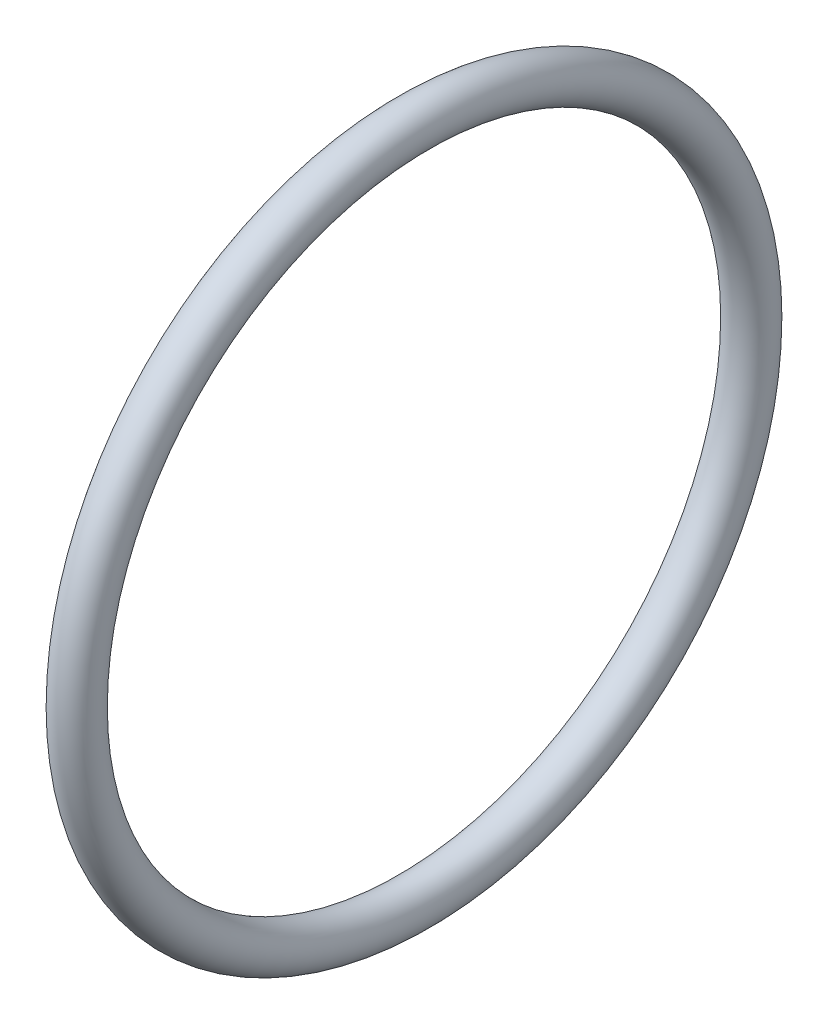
from build123d import *

# Parameters (mm, degrees)
SKETCH1_R = 1.7653


with BuildPart() as part:
    # Sketch1 → Revolve1 (revolve)
    with BuildSketch(Plane.XY, mode=Mode.PRIVATE) as revolve1_sk:
        with Locations((0, 27.497214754)):
            Circle(SKETCH1_R)
    revolve(revolve1_sk.sketch.rotate(Axis((0, 0, 0), (-1, 0, 0)), 90), axis=Axis((0, 0, 0), (-1, 0, 0)))


solid = part.part
